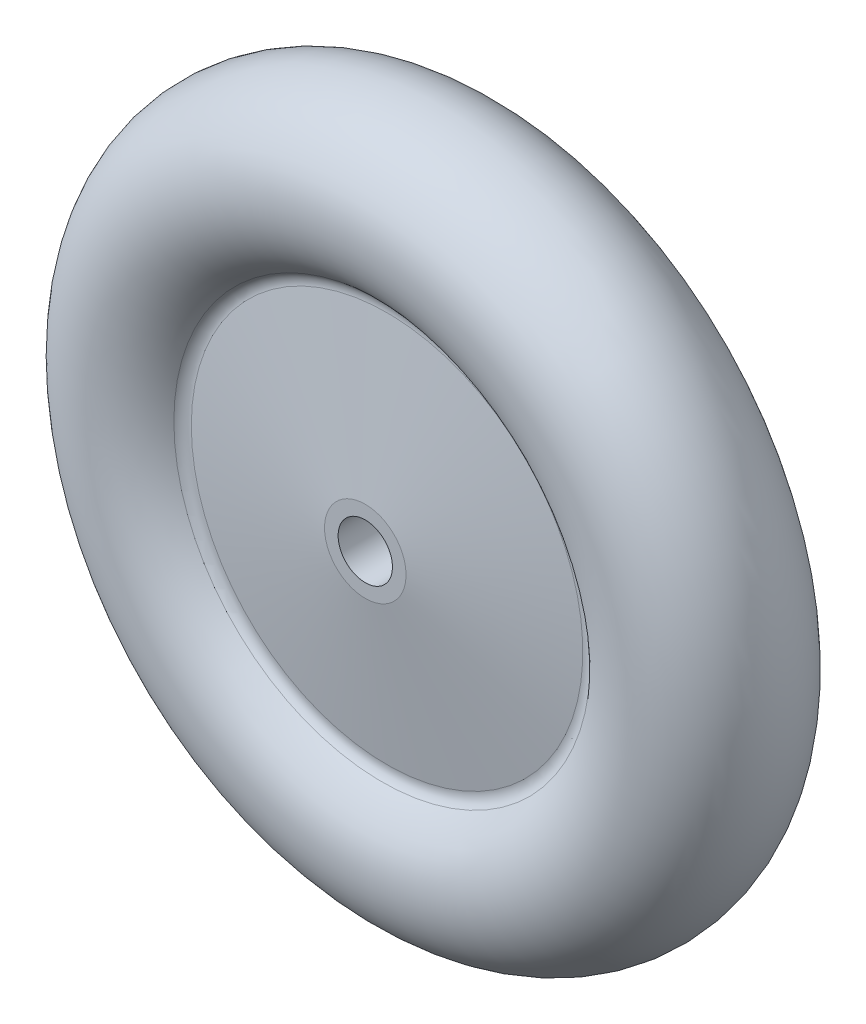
from build123d import *


with BuildPart() as part:
    # Sketch1 → Revolve1 (revolve)
    with BuildSketch(Plane(origin=(0, 0, 0), x_dir=(0, 0, -1), z_dir=(1, 0, 0)), mode=Mode.PRIVATE) as revolve1_sk:
        with BuildLine():
            Line((5, 2), (-5, 2))
            Line((-5, 2), (-5, 3))
            Line((-5, 3), (-3.397210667, 14.406495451))
            ThreePointArc((-3.397210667, 14.406495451), (-3.457667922, 14.913673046), (-3.760699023, 15.324837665))
            ThreePointArc((-3.760699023, 15.324837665), (0, 26), (3.760699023, 15.324837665))
            ThreePointArc((3.760699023, 15.324837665), (3.457667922, 14.913673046), (3.397210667, 14.406495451))
            Line((3.397210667, 14.406495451), (5, 3))
            Line((5, 3), (5, 2))
        make_face()
    revolve(revolve1_sk.sketch.rotate(Axis((0, 0, -18.162203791), (0, 0, 1)), 90), axis=Axis((0, 0, -18.162203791), (0, 0, 1)))


solid = part.part
